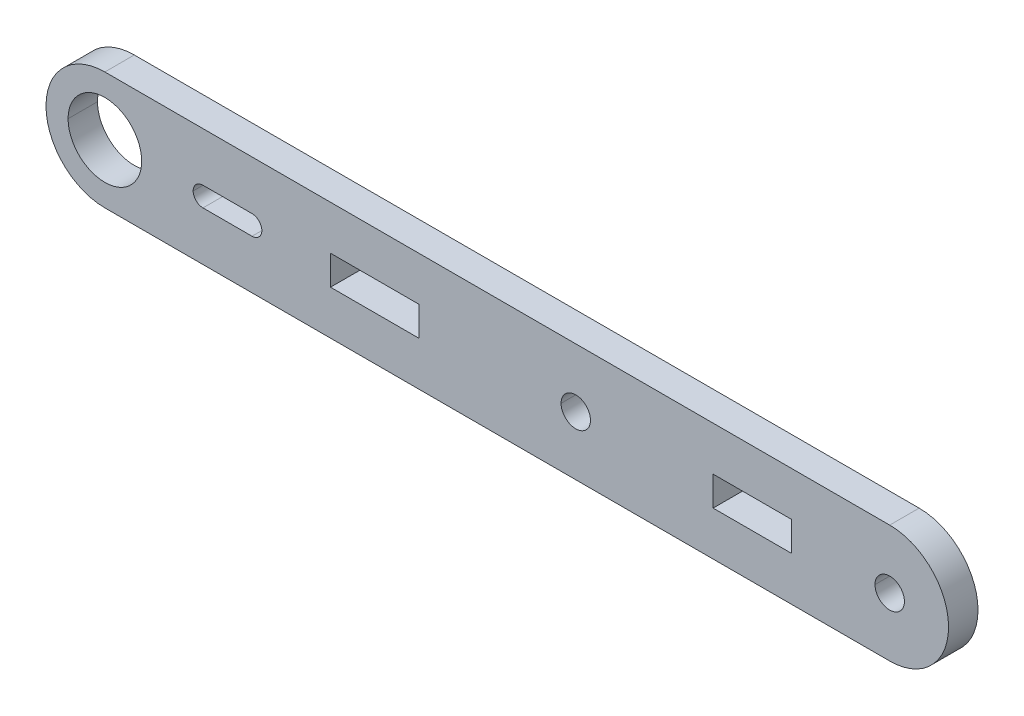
ISO-10303-21;
HEADER;
FILE_DESCRIPTION(('STEP AP214'),'2;1');
FILE_NAME('part.step','',(''),(''),'','','');
FILE_SCHEMA(('AUTOMOTIVE_DESIGN { 1 0 10303 214 1 1 1 1 }'));
ENDSEC;
DATA;
#1=APPLICATION_CONTEXT('core data for automotive mechanical design processes');
#2=APPLICATION_PROTOCOL_DEFINITION('international standard','automotive_design',2000,#1);
#3=PRODUCT_CONTEXT('',#1,'mechanical');
#4=PRODUCT('Part','Part','',(#3));
#5=PRODUCT_RELATED_PRODUCT_CATEGORY('part','',(#4));
#6=PRODUCT_DEFINITION_FORMATION('','',#4);
#7=PRODUCT_DEFINITION_CONTEXT('part definition',#1,'design');
#8=PRODUCT_DEFINITION('design','',#6,#7);
#9=PRODUCT_DEFINITION_SHAPE('','',#8);
#10=(LENGTH_UNIT() NAMED_UNIT(*) SI_UNIT(.MILLI.,.METRE.));
#11=(NAMED_UNIT(*) PLANE_ANGLE_UNIT() SI_UNIT($,.RADIAN.));
#12=(NAMED_UNIT(*) SI_UNIT($,.STERADIAN.) SOLID_ANGLE_UNIT());
#13=UNCERTAINTY_MEASURE_WITH_UNIT(LENGTH_MEASURE(1.E-05),#10,'distance_accuracy_value','');
#14=(GEOMETRIC_REPRESENTATION_CONTEXT(3) GLOBAL_UNCERTAINTY_ASSIGNED_CONTEXT((#13)) GLOBAL_UNIT_ASSIGNED_CONTEXT((#10,
#11,#12)) REPRESENTATION_CONTEXT('',''));
#15=CARTESIAN_POINT('',(0.,0.,0.));
#16=DIRECTION('',(0.,0.,1.));
#17=DIRECTION('',(1.,0.,0.));
#18=AXIS2_PLACEMENT_3D('',#15,#16,#17);
#19=CARTESIAN_POINT('',(-53.0402925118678,-53.50506394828,3.));
#20=DIRECTION('',(0.,0.,-1.));
#21=DIRECTION('',(-1.,0.,0.));
#22=AXIS2_PLACEMENT_3D('',#19,#20,#21);
#23=CYLINDRICAL_SURFACE('',#22,1.);
#24=DIRECTION('',(0.,0.,-1.));
#25=VECTOR('',#24,1.);
#26=CARTESIAN_POINT('',(-54.0402925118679,-53.50506394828,3.));
#27=LINE('',#26,#25);
#28=CARTESIAN_POINT('',(-54.0402925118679,-53.50506394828,3.));
#29=VERTEX_POINT('',#28);
#30=CARTESIAN_POINT('',(-54.0402925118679,-53.50506394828,0.));
#31=VERTEX_POINT('',#30);
#32=EDGE_CURVE('E193',#29,#31,#27,.T.);
#33=ORIENTED_EDGE('',*,*,#32,.T.);
#34=CARTESIAN_POINT('',(-53.0402925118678,-53.50506394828,0.));
#35=DIRECTION('',(0.,0.,-1.));
#36=DIRECTION('',(-1.,0.,0.));
#37=AXIS2_PLACEMENT_3D('',#34,#35,#36);
#38=CIRCLE('',#37,1.);
#39=CARTESIAN_POINT('',(-53.0402925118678,-52.50506394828,0.));
#40=VERTEX_POINT('',#39);
#41=EDGE_CURVE('E18',#40,#31,#38,.F.);
#42=ORIENTED_EDGE('',*,*,#41,.F.);
#43=DIRECTION('',(0.,0.,-1.));
#44=VECTOR('',#43,1.);
#45=CARTESIAN_POINT('',(-53.0402925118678,-52.50506394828,3.));
#46=LINE('',#45,#44);
#47=CARTESIAN_POINT('',(-53.0402925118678,-52.50506394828,3.));
#48=VERTEX_POINT('',#47);
#49=EDGE_CURVE('E213',#48,#40,#46,.T.);
#50=ORIENTED_EDGE('',*,*,#49,.F.);
#51=CARTESIAN_POINT('',(-53.0402925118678,-53.50506394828,3.));
#52=DIRECTION('',(0.,0.,-1.));
#53=DIRECTION('',(-1.,0.,0.));
#54=AXIS2_PLACEMENT_3D('',#51,#52,#53);
#55=CIRCLE('',#54,1.);
#56=EDGE_CURVE('E196',#29,#48,#55,.T.);
#57=ORIENTED_EDGE('',*,*,#56,.F.);
#58=EDGE_LOOP('',(#33,#42,#50,#57));
#59=FACE_BOUND('',#58,.T.);
#60=ADVANCED_FACE('F15',(#59),#23,.F.);
#61=CARTESIAN_POINT('',(-53.0402925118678,-53.50506394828,3.));
#62=DIRECTION('',(0.,0.,-1.));
#63=DIRECTION('',(-1.,0.,0.));
#64=AXIS2_PLACEMENT_3D('',#61,#62,#63);
#65=CYLINDRICAL_SURFACE('',#64,1.);
#66=CARTESIAN_POINT('',(-53.0402925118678,-53.50506394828,3.));
#67=DIRECTION('',(0.,0.,-1.));
#68=DIRECTION('',(-1.,0.,0.));
#69=AXIS2_PLACEMENT_3D('',#66,#67,#68);
#70=CIRCLE('',#69,1.);
#71=CARTESIAN_POINT('',(-53.0402925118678,-54.50506394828,3.));
#72=VERTEX_POINT('',#71);
#73=EDGE_CURVE('E191',#72,#29,#70,.T.);
#74=ORIENTED_EDGE('',*,*,#73,.F.);
#75=DIRECTION('',(0.,0.,1.));
#76=VECTOR('',#75,1.);
#77=CARTESIAN_POINT('',(-53.0402925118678,-54.50506394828,3.));
#78=LINE('',#77,#76);
#79=CARTESIAN_POINT('',(-53.0402925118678,-54.50506394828,0.));
#80=VERTEX_POINT('',#79);
#81=EDGE_CURVE('E180',#80,#72,#78,.T.);
#82=ORIENTED_EDGE('',*,*,#81,.F.);
#83=CARTESIAN_POINT('',(-53.0402925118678,-53.50506394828,0.));
#84=DIRECTION('',(0.,0.,-1.));
#85=DIRECTION('',(-1.,0.,0.));
#86=AXIS2_PLACEMENT_3D('',#83,#84,#85);
#87=CIRCLE('',#86,1.);
#88=EDGE_CURVE('E33',#31,#80,#87,.F.);
#89=ORIENTED_EDGE('',*,*,#88,.F.);
#90=ORIENTED_EDGE('',*,*,#32,.F.);
#91=EDGE_LOOP('',(#74,#82,#89,#90));
#92=FACE_BOUND('',#91,.T.);
#93=ADVANCED_FACE('F192',(#92),#65,.F.);
#94=CARTESIAN_POINT('',(-63.0402925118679,-53.50506394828,3.));
#95=DIRECTION('',(0.,0.,1.));
#96=DIRECTION('',(1.,0.,0.));
#97=AXIS2_PLACEMENT_3D('',#94,#95,#96);
#98=PLANE('',#97);
#99=DIRECTION('',(1.,0.,0.));
#100=VECTOR('',#99,1.);
#101=CARTESIAN_POINT('',(-53.0402925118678,-52.50506394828,3.));
#102=LINE('',#101,#100);
#103=CARTESIAN_POINT('',(-48.0402925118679,-52.50506394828,3.));
#104=VERTEX_POINT('',#103);
#105=EDGE_CURVE('E210',#104,#48,#102,.F.);
#106=ORIENTED_EDGE('',*,*,#105,.F.);
#107=CARTESIAN_POINT('',(-48.0402925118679,-53.50506394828,3.));
#108=DIRECTION('',(0.,0.,-1.));
#109=DIRECTION('',(-1.,0.,0.));
#110=AXIS2_PLACEMENT_3D('',#107,#108,#109);
#111=CIRCLE('',#110,1.);
#112=CARTESIAN_POINT('',(-48.0402925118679,-54.50506394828,3.));
#113=VERTEX_POINT('',#112);
#114=EDGE_CURVE('E187',#104,#113,#111,.T.);
#115=ORIENTED_EDGE('',*,*,#114,.T.);
#116=DIRECTION('',(1.,0.,0.));
#117=VECTOR('',#116,1.);
#118=CARTESIAN_POINT('',(-53.0402925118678,-54.50506394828,3.));
#119=LINE('',#118,#117);
#120=EDGE_CURVE('E184',#72,#113,#119,.T.);
#121=ORIENTED_EDGE('',*,*,#120,.F.);
#122=ORIENTED_EDGE('',*,*,#73,.T.);
#123=ORIENTED_EDGE('',*,*,#56,.T.);
#124=EDGE_LOOP('',(#106,#115,#121,#122,#123));
#125=FACE_BOUND('',#124,.T.);
#126=DIRECTION('',(1.,0.,0.));
#127=VECTOR('',#126,1.);
#128=CARTESIAN_POINT('',(-31.0402925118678,-55.00506394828,3.));
#129=LINE('',#128,#127);
#130=CARTESIAN_POINT('',(-40.0402925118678,-55.00506394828,3.));
#131=VERTEX_POINT('',#130);
#132=CARTESIAN_POINT('',(-31.0402925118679,-55.00506394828,3.));
#133=VERTEX_POINT('',#132);
#134=EDGE_CURVE('E264',#131,#133,#129,.T.);
#135=ORIENTED_EDGE('',*,*,#134,.F.);
#136=DIRECTION('',(0.,1.,0.));
#137=VECTOR('',#136,1.);
#138=CARTESIAN_POINT('',(-40.0402925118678,-55.00506394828,3.));
#139=LINE('',#138,#137);
#140=CARTESIAN_POINT('',(-40.0402925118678,-52.00506394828,3.));
#141=VERTEX_POINT('',#140);
#142=EDGE_CURVE('E315',#141,#131,#139,.F.);
#143=ORIENTED_EDGE('',*,*,#142,.F.);
#144=DIRECTION('',(1.,0.,0.));
#145=VECTOR('',#144,1.);
#146=CARTESIAN_POINT('',(-31.0402925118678,-52.00506394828,3.));
#147=LINE('',#146,#145);
#148=CARTESIAN_POINT('',(-31.0402925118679,-52.00506394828,3.));
#149=VERTEX_POINT('',#148);
#150=EDGE_CURVE('E311',#149,#141,#147,.F.);
#151=ORIENTED_EDGE('',*,*,#150,.F.);
#152=DIRECTION('',(0.,1.,0.));
#153=VECTOR('',#152,1.);
#154=CARTESIAN_POINT('',(-31.0402925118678,-55.00506394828,3.));
#155=LINE('',#154,#153);
#156=EDGE_CURVE('E304',#133,#149,#155,.T.);
#157=ORIENTED_EDGE('',*,*,#156,.F.);
#158=EDGE_LOOP('',(#135,#143,#151,#157));
#159=FACE_BOUND('',#158,.T.);
#160=CARTESIAN_POINT('',(16.9597074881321,-53.50506394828,3.));
#161=DIRECTION('',(0.,0.,-1.));
#162=DIRECTION('',(-1.,0.,0.));
#163=AXIS2_PLACEMENT_3D('',#160,#161,#162);
#164=CIRCLE('',#163,1.50000000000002);
#165=CARTESIAN_POINT('',(18.4597074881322,-53.50506394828,3.));
#166=VERTEX_POINT('',#165);
#167=CARTESIAN_POINT('',(15.4597074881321,-53.50506394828,3.));
#168=VERTEX_POINT('',#167);
#169=EDGE_CURVE('E261',#166,#168,#164,.T.);
#170=ORIENTED_EDGE('',*,*,#169,.T.);
#171=CARTESIAN_POINT('',(16.9597074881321,-53.50506394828,3.));
#172=DIRECTION('',(0.,0.,-1.));
#173=DIRECTION('',(-1.,0.,0.));
#174=AXIS2_PLACEMENT_3D('',#171,#172,#173);
#175=CIRCLE('',#174,1.50000000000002);
#176=EDGE_CURVE('E266',#168,#166,#175,.T.);
#177=ORIENTED_EDGE('',*,*,#176,.T.);
#178=EDGE_LOOP('',(#170,#177));
#179=FACE_BOUND('',#178,.T.);
#180=CARTESIAN_POINT('',(16.9597074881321,-53.50506394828,3.));
#181=DIRECTION('',(0.,0.,-1.));
#182=DIRECTION('',(-1.,0.,0.));
#183=AXIS2_PLACEMENT_3D('',#180,#181,#182);
#184=CIRCLE('',#183,6.00000000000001);
#185=CARTESIAN_POINT('',(16.9597074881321,-47.50506394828,3.));
#186=VERTEX_POINT('',#185);
#187=CARTESIAN_POINT('',(16.9597074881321,-59.50506394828,3.));
#188=VERTEX_POINT('',#187);
#189=EDGE_CURVE('E222',#186,#188,#184,.T.);
#190=ORIENTED_EDGE('',*,*,#189,.F.);
#191=DIRECTION('',(1.,0.,0.));
#192=VECTOR('',#191,1.);
#193=CARTESIAN_POINT('',(-63.0402925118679,-47.50506394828,3.));
#194=LINE('',#193,#192);
#195=CARTESIAN_POINT('',(-63.0402925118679,-47.50506394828,3.));
#196=VERTEX_POINT('',#195);
#197=EDGE_CURVE('E214',#186,#196,#194,.F.);
#198=ORIENTED_EDGE('',*,*,#197,.T.);
#199=CARTESIAN_POINT('',(-63.0402925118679,-53.50506394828,3.));
#200=DIRECTION('',(0.,0.,-1.));
#201=DIRECTION('',(-1.,0.,0.));
#202=AXIS2_PLACEMENT_3D('',#199,#200,#201);
#203=CIRCLE('',#202,6.00000000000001);
#204=CARTESIAN_POINT('',(-69.0402925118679,-53.50506394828,3.));
#205=VERTEX_POINT('',#204);
#206=EDGE_CURVE('E270',#205,#196,#203,.T.);
#207=ORIENTED_EDGE('',*,*,#206,.F.);
#208=CARTESIAN_POINT('',(-63.0402925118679,-53.50506394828,3.));
#209=DIRECTION('',(0.,0.,-1.));
#210=DIRECTION('',(-1.,0.,0.));
#211=AXIS2_PLACEMENT_3D('',#208,#209,#210);
#212=CIRCLE('',#211,6.00000000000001);
#213=CARTESIAN_POINT('',(-63.0402925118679,-59.50506394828,3.));
#214=VERTEX_POINT('',#213);
#215=EDGE_CURVE('E274',#214,#205,#212,.T.);
#216=ORIENTED_EDGE('',*,*,#215,.F.);
#217=DIRECTION('',(-1.,0.,0.));
#218=VECTOR('',#217,1.);
#219=CARTESIAN_POINT('',(-63.0402925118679,-59.50506394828,3.));
#220=LINE('',#219,#218);
#221=EDGE_CURVE('E219',#214,#188,#220,.F.);
#222=ORIENTED_EDGE('',*,*,#221,.T.);
#223=EDGE_LOOP('',(#190,#198,#207,#216,#222));
#224=FACE_BOUND('',#223,.T.);
#225=CARTESIAN_POINT('',(-15.0402925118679,-53.50506394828,3.));
#226=DIRECTION('',(0.,0.,-1.));
#227=DIRECTION('',(-1.,0.,0.));
#228=AXIS2_PLACEMENT_3D('',#225,#226,#227);
#229=CIRCLE('',#228,1.5);
#230=CARTESIAN_POINT('',(-13.5402925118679,-53.50506394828,3.));
#231=VERTEX_POINT('',#230);
#232=CARTESIAN_POINT('',(-16.5402925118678,-53.50506394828,3.));
#233=VERTEX_POINT('',#232);
#234=EDGE_CURVE('E276',#231,#233,#229,.T.);
#235=ORIENTED_EDGE('',*,*,#234,.T.);
#236=CARTESIAN_POINT('',(-15.0402925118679,-53.50506394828,3.));
#237=DIRECTION('',(0.,0.,-1.));
#238=DIRECTION('',(-1.,0.,0.));
#239=AXIS2_PLACEMENT_3D('',#236,#237,#238);
#240=CIRCLE('',#239,1.5);
#241=EDGE_CURVE('E280',#233,#231,#240,.T.);
#242=ORIENTED_EDGE('',*,*,#241,.T.);
#243=EDGE_LOOP('',(#235,#242));
#244=FACE_BOUND('',#243,.T.);
#245=CARTESIAN_POINT('',(-63.0402925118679,-53.50506394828,3.));
#246=DIRECTION('',(0.,0.,-1.));
#247=DIRECTION('',(-1.,0.,0.));
#248=AXIS2_PLACEMENT_3D('',#245,#246,#247);
#249=CIRCLE('',#248,3.75);
#250=CARTESIAN_POINT('',(-59.2902925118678,-53.50506394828,3.));
#251=VERTEX_POINT('',#250);
#252=CARTESIAN_POINT('',(-66.7902925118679,-53.50506394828,3.));
#253=VERTEX_POINT('',#252);
#254=EDGE_CURVE('E283',#251,#253,#249,.T.);
#255=ORIENTED_EDGE('',*,*,#254,.T.);
#256=CARTESIAN_POINT('',(-63.0402925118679,-53.50506394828,3.));
#257=DIRECTION('',(0.,0.,-1.));
#258=DIRECTION('',(-1.,0.,0.));
#259=AXIS2_PLACEMENT_3D('',#256,#257,#258);
#260=CIRCLE('',#259,3.75);
#261=EDGE_CURVE('E287',#253,#251,#260,.T.);
#262=ORIENTED_EDGE('',*,*,#261,.T.);
#263=EDGE_LOOP('',(#255,#262));
#264=FACE_BOUND('',#263,.T.);
#265=DIRECTION('',(1.,0.,0.));
#266=VECTOR('',#265,1.);
#267=CARTESIAN_POINT('',(6.95970748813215,-55.00506394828,3.));
#268=LINE('',#267,#266);
#269=CARTESIAN_POINT('',(-1.04029251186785,-55.00506394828,3.));
#270=VERTEX_POINT('',#269);
#271=CARTESIAN_POINT('',(6.95970748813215,-55.00506394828,3.));
#272=VERTEX_POINT('',#271);
#273=EDGE_CURVE('E208',#270,#272,#268,.T.);
#274=ORIENTED_EDGE('',*,*,#273,.F.);
#275=DIRECTION('',(0.,1.,0.));
#276=VECTOR('',#275,1.);
#277=CARTESIAN_POINT('',(-1.04029251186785,-55.00506394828,3.));
#278=LINE('',#277,#276);
#279=CARTESIAN_POINT('',(-1.04029251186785,-52.00506394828,3.));
#280=VERTEX_POINT('',#279);
#281=EDGE_CURVE('E349',#280,#270,#278,.F.);
#282=ORIENTED_EDGE('',*,*,#281,.F.);
#283=DIRECTION('',(1.,0.,0.));
#284=VECTOR('',#283,1.);
#285=CARTESIAN_POINT('',(6.95970748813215,-52.00506394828,3.));
#286=LINE('',#285,#284);
#287=CARTESIAN_POINT('',(6.95970748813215,-52.00506394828,3.));
#288=VERTEX_POINT('',#287);
#289=EDGE_CURVE('E346',#288,#280,#286,.F.);
#290=ORIENTED_EDGE('',*,*,#289,.F.);
#291=DIRECTION('',(0.,-1.,0.));
#292=VECTOR('',#291,1.);
#293=CARTESIAN_POINT('',(6.95970748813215,-55.00506394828,3.));
#294=LINE('',#293,#292);
#295=EDGE_CURVE('E339',#272,#288,#294,.F.);
#296=ORIENTED_EDGE('',*,*,#295,.F.);
#297=EDGE_LOOP('',(#274,#282,#290,#296));
#298=FACE_BOUND('',#297,.T.);
#299=ADVANCED_FACE('F198',(#125,#159,#179,#224,#244,#264,#298),#98,.T.);
#300=CARTESIAN_POINT('',(6.95970748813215,-55.00506394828,3.));
#301=DIRECTION('',(0.,1.,0.));
#302=DIRECTION('',(0.,0.,1.));
#303=AXIS2_PLACEMENT_3D('',#300,#301,#302);
#304=PLANE('',#303);
#305=ORIENTED_EDGE('',*,*,#273,.T.);
#306=DIRECTION('',(0.,0.,1.));
#307=VECTOR('',#306,1.);
#308=CARTESIAN_POINT('',(6.95970748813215,-55.00506394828,3.));
#309=LINE('',#308,#307);
#310=CARTESIAN_POINT('',(6.95970748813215,-55.00506394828,0.));
#311=VERTEX_POINT('',#310);
#312=EDGE_CURVE('E341',#311,#272,#309,.T.);
#313=ORIENTED_EDGE('',*,*,#312,.F.);
#314=DIRECTION('',(1.,0.,0.));
#315=VECTOR('',#314,1.);
#316=CARTESIAN_POINT('',(-63.0402925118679,-55.00506394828,0.));
#317=LINE('',#316,#315);
#318=CARTESIAN_POINT('',(-1.04029251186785,-55.00506394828,0.));
#319=VERTEX_POINT('',#318);
#320=EDGE_CURVE('E204',#311,#319,#317,.F.);
#321=ORIENTED_EDGE('',*,*,#320,.T.);
#322=DIRECTION('',(0.,0.,1.));
#323=VECTOR('',#322,1.);
#324=CARTESIAN_POINT('',(-1.04029251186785,-55.00506394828,3.));
#325=LINE('',#324,#323);
#326=EDGE_CURVE('E348',#270,#319,#325,.F.);
#327=ORIENTED_EDGE('',*,*,#326,.F.);
#328=EDGE_LOOP('',(#305,#313,#321,#327));
#329=FACE_BOUND('',#328,.T.);
#330=ADVANCED_FACE('F357',(#329),#304,.T.);
#331=CARTESIAN_POINT('',(-1.04029251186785,-55.00506394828,3.));
#332=DIRECTION('',(1.,0.,0.));
#333=DIRECTION('',(0.,1.,0.));
#334=AXIS2_PLACEMENT_3D('',#331,#332,#333);
#335=PLANE('',#334);
#336=ORIENTED_EDGE('',*,*,#281,.T.);
#337=ORIENTED_EDGE('',*,*,#326,.T.);
#338=DIRECTION('',(0.,1.,0.));
#339=VECTOR('',#338,1.);
#340=CARTESIAN_POINT('',(-1.04029251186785,-53.50506394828,0.));
#341=LINE('',#340,#339);
#342=CARTESIAN_POINT('',(-1.04029251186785,-52.00506394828,0.));
#343=VERTEX_POINT('',#342);
#344=EDGE_CURVE('E376',#319,#343,#341,.T.);
#345=ORIENTED_EDGE('',*,*,#344,.T.);
#346=DIRECTION('',(0.,0.,1.));
#347=VECTOR('',#346,1.);
#348=CARTESIAN_POINT('',(-1.04029251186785,-52.00506394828,3.));
#349=LINE('',#348,#347);
#350=EDGE_CURVE('E344',#280,#343,#349,.F.);
#351=ORIENTED_EDGE('',*,*,#350,.F.);
#352=EDGE_LOOP('',(#336,#337,#345,#351));
#353=FACE_BOUND('',#352,.T.);
#354=ADVANCED_FACE('F382',(#353),#335,.T.);
#355=CARTESIAN_POINT('',(6.95970748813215,-52.00506394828,3.));
#356=DIRECTION('',(0.,-1.,0.));
#357=DIRECTION('',(1.,0.,0.));
#358=AXIS2_PLACEMENT_3D('',#355,#356,#357);
#359=PLANE('',#358);
#360=ORIENTED_EDGE('',*,*,#289,.T.);
#361=ORIENTED_EDGE('',*,*,#350,.T.);
#362=DIRECTION('',(1.,0.,0.));
#363=VECTOR('',#362,1.);
#364=CARTESIAN_POINT('',(-63.0402925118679,-52.00506394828,0.));
#365=LINE('',#364,#363);
#366=CARTESIAN_POINT('',(6.95970748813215,-52.00506394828,0.));
#367=VERTEX_POINT('',#366);
#368=EDGE_CURVE('E371',#343,#367,#365,.T.);
#369=ORIENTED_EDGE('',*,*,#368,.T.);
#370=DIRECTION('',(0.,0.,1.));
#371=VECTOR('',#370,1.);
#372=CARTESIAN_POINT('',(6.95970748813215,-52.00506394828,3.));
#373=LINE('',#372,#371);
#374=EDGE_CURVE('E290',#288,#367,#373,.F.);
#375=ORIENTED_EDGE('',*,*,#374,.F.);
#376=EDGE_LOOP('',(#360,#361,#369,#375));
#377=FACE_BOUND('',#376,.T.);
#378=ADVANCED_FACE('F369',(#377),#359,.T.);
#379=CARTESIAN_POINT('',(6.95970748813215,-55.00506394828,3.));
#380=DIRECTION('',(-1.,0.,0.));
#381=DIRECTION('',(0.,-1.,0.));
#382=AXIS2_PLACEMENT_3D('',#379,#380,#381);
#383=PLANE('',#382);
#384=ORIENTED_EDGE('',*,*,#295,.T.);
#385=ORIENTED_EDGE('',*,*,#374,.T.);
#386=DIRECTION('',(0.,1.,0.));
#387=VECTOR('',#386,1.);
#388=CARTESIAN_POINT('',(6.95970748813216,-53.50506394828,0.));
#389=LINE('',#388,#387);
#390=EDGE_CURVE('E258',#367,#311,#389,.F.);
#391=ORIENTED_EDGE('',*,*,#390,.T.);
#392=ORIENTED_EDGE('',*,*,#312,.T.);
#393=EDGE_LOOP('',(#384,#385,#391,#392));
#394=FACE_BOUND('',#393,.T.);
#395=ADVANCED_FACE('F363',(#394),#383,.T.);
#396=CARTESIAN_POINT('',(-63.0402925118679,-53.50506394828,3.));
#397=DIRECTION('',(0.,0.,-1.));
#398=DIRECTION('',(-1.,0.,0.));
#399=AXIS2_PLACEMENT_3D('',#396,#397,#398);
#400=CYLINDRICAL_SURFACE('',#399,3.75);
#401=ORIENTED_EDGE('',*,*,#261,.F.);
#402=DIRECTION('',(0.,0.,-1.));
#403=VECTOR('',#402,1.);
#404=CARTESIAN_POINT('',(-66.7902925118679,-53.50506394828,3.));
#405=LINE('',#404,#403);
#406=CARTESIAN_POINT('',(-66.7902925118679,-53.50506394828,0.));
#407=VERTEX_POINT('',#406);
#408=EDGE_CURVE('E289',#253,#407,#405,.T.);
#409=ORIENTED_EDGE('',*,*,#408,.T.);
#410=CARTESIAN_POINT('',(-63.0402925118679,-53.50506394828,0.));
#411=DIRECTION('',(0.,0.,-1.));
#412=DIRECTION('',(-1.,0.,0.));
#413=AXIS2_PLACEMENT_3D('',#410,#411,#412);
#414=CIRCLE('',#413,3.75);
#415=CARTESIAN_POINT('',(-59.2902925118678,-53.50506394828,0.));
#416=VERTEX_POINT('',#415);
#417=EDGE_CURVE('E255',#407,#416,#414,.T.);
#418=ORIENTED_EDGE('',*,*,#417,.T.);
#419=DIRECTION('',(0.,0.,-1.));
#420=VECTOR('',#419,1.);
#421=CARTESIAN_POINT('',(-59.2902925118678,-53.50506394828,3.));
#422=LINE('',#421,#420);
#423=EDGE_CURVE('E286',#416,#251,#422,.F.);
#424=ORIENTED_EDGE('',*,*,#423,.T.);
#425=EDGE_LOOP('',(#401,#409,#418,#424));
#426=FACE_BOUND('',#425,.T.);
#427=ADVANCED_FACE('F458',(#426),#400,.F.);
#428=CARTESIAN_POINT('',(-63.0402925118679,-53.50506394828,3.));
#429=DIRECTION('',(0.,0.,-1.));
#430=DIRECTION('',(-1.,0.,0.));
#431=AXIS2_PLACEMENT_3D('',#428,#429,#430);
#432=CYLINDRICAL_SURFACE('',#431,3.75);
#433=ORIENTED_EDGE('',*,*,#423,.F.);
#434=CARTESIAN_POINT('',(-63.0402925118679,-53.50506394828,0.));
#435=DIRECTION('',(0.,0.,-1.));
#436=DIRECTION('',(-1.,0.,0.));
#437=AXIS2_PLACEMENT_3D('',#434,#435,#436);
#438=CIRCLE('',#437,3.75);
#439=EDGE_CURVE('E252',#416,#407,#438,.T.);
#440=ORIENTED_EDGE('',*,*,#439,.T.);
#441=ORIENTED_EDGE('',*,*,#408,.F.);
#442=ORIENTED_EDGE('',*,*,#254,.F.);
#443=EDGE_LOOP('',(#433,#440,#441,#442));
#444=FACE_BOUND('',#443,.T.);
#445=ADVANCED_FACE('F454',(#444),#432,.F.);
#446=CARTESIAN_POINT('',(-15.0402925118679,-53.50506394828,3.));
#447=DIRECTION('',(0.,0.,-1.));
#448=DIRECTION('',(-1.,0.,0.));
#449=AXIS2_PLACEMENT_3D('',#446,#447,#448);
#450=CYLINDRICAL_SURFACE('',#449,1.5);
#451=ORIENTED_EDGE('',*,*,#241,.F.);
#452=DIRECTION('',(0.,0.,-1.));
#453=VECTOR('',#452,1.);
#454=CARTESIAN_POINT('',(-16.5402925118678,-53.50506394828,3.));
#455=LINE('',#454,#453);
#456=CARTESIAN_POINT('',(-16.5402925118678,-53.50506394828,0.));
#457=VERTEX_POINT('',#456);
#458=EDGE_CURVE('E282',#233,#457,#455,.T.);
#459=ORIENTED_EDGE('',*,*,#458,.T.);
#460=CARTESIAN_POINT('',(-15.0402925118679,-53.50506394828,0.));
#461=DIRECTION('',(0.,0.,-1.));
#462=DIRECTION('',(-1.,0.,0.));
#463=AXIS2_PLACEMENT_3D('',#460,#461,#462);
#464=CIRCLE('',#463,1.5);
#465=CARTESIAN_POINT('',(-13.5402925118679,-53.50506394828,0.));
#466=VERTEX_POINT('',#465);
#467=EDGE_CURVE('E249',#457,#466,#464,.T.);
#468=ORIENTED_EDGE('',*,*,#467,.T.);
#469=DIRECTION('',(0.,0.,-1.));
#470=VECTOR('',#469,1.);
#471=CARTESIAN_POINT('',(-13.5402925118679,-53.50506394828,3.));
#472=LINE('',#471,#470);
#473=EDGE_CURVE('E279',#466,#231,#472,.F.);
#474=ORIENTED_EDGE('',*,*,#473,.T.);
#475=EDGE_LOOP('',(#451,#459,#468,#474));
#476=FACE_BOUND('',#475,.T.);
#477=ADVANCED_FACE('F450',(#476),#450,.F.);
#478=CARTESIAN_POINT('',(-15.0402925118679,-53.50506394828,3.));
#479=DIRECTION('',(0.,0.,-1.));
#480=DIRECTION('',(-1.,0.,0.));
#481=AXIS2_PLACEMENT_3D('',#478,#479,#480);
#482=CYLINDRICAL_SURFACE('',#481,1.5);
#483=ORIENTED_EDGE('',*,*,#473,.F.);
#484=CARTESIAN_POINT('',(-15.0402925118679,-53.50506394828,0.));
#485=DIRECTION('',(0.,0.,-1.));
#486=DIRECTION('',(-1.,0.,0.));
#487=AXIS2_PLACEMENT_3D('',#484,#485,#486);
#488=CIRCLE('',#487,1.5);
#489=EDGE_CURVE('E246',#466,#457,#488,.T.);
#490=ORIENTED_EDGE('',*,*,#489,.T.);
#491=ORIENTED_EDGE('',*,*,#458,.F.);
#492=ORIENTED_EDGE('',*,*,#234,.F.);
#493=EDGE_LOOP('',(#483,#490,#491,#492));
#494=FACE_BOUND('',#493,.T.);
#495=ADVANCED_FACE('F446',(#494),#482,.F.);
#496=CARTESIAN_POINT('',(-63.0402925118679,-53.50506394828,3.));
#497=DIRECTION('',(0.,0.,-1.));
#498=DIRECTION('',(-1.,0.,0.));
#499=AXIS2_PLACEMENT_3D('',#496,#497,#498);
#500=CYLINDRICAL_SURFACE('',#499,6.00000000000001);
#501=CARTESIAN_POINT('',(-63.0402925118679,-53.50506394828,0.));
#502=DIRECTION('',(0.,0.,-1.));
#503=DIRECTION('',(-1.,0.,0.));
#504=AXIS2_PLACEMENT_3D('',#501,#502,#503);
#505=CIRCLE('',#504,6.00000000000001);
#506=CARTESIAN_POINT('',(-69.0402925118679,-53.50506394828,0.));
#507=VERTEX_POINT('',#506);
#508=CARTESIAN_POINT('',(-63.0402925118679,-59.50506394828,0.));
#509=VERTEX_POINT('',#508);
#510=EDGE_CURVE('E243',#507,#509,#505,.F.);
#511=ORIENTED_EDGE('',*,*,#510,.T.);
#512=DIRECTION('',(0.,0.,1.));
#513=VECTOR('',#512,1.);
#514=CARTESIAN_POINT('',(-63.0402925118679,-59.50506394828,3.));
#515=LINE('',#514,#513);
#516=EDGE_CURVE('E223',#509,#214,#515,.T.);
#517=ORIENTED_EDGE('',*,*,#516,.T.);
#518=ORIENTED_EDGE('',*,*,#215,.T.);
#519=DIRECTION('',(0.,0.,-1.));
#520=VECTOR('',#519,1.);
#521=CARTESIAN_POINT('',(-69.0402925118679,-53.50506394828,3.));
#522=LINE('',#521,#520);
#523=EDGE_CURVE('E217',#507,#205,#522,.F.);
#524=ORIENTED_EDGE('',*,*,#523,.F.);
#525=EDGE_LOOP('',(#511,#517,#518,#524));
#526=FACE_BOUND('',#525,.T.);
#527=ADVANCED_FACE('F442',(#526),#500,.T.);
#528=CARTESIAN_POINT('',(-63.0402925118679,-59.50506394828,3.));
#529=DIRECTION('',(0.,1.,0.));
#530=DIRECTION('',(-1.,0.,0.));
#531=AXIS2_PLACEMENT_3D('',#528,#529,#530);
#532=PLANE('',#531);
#533=DIRECTION('',(0.,0.,-1.));
#534=VECTOR('',#533,1.);
#535=CARTESIAN_POINT('',(16.9597074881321,-59.50506394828,3.));
#536=LINE('',#535,#534);
#537=CARTESIAN_POINT('',(16.9597074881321,-59.50506394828,0.));
#538=VERTEX_POINT('',#537);
#539=EDGE_CURVE('E273',#188,#538,#536,.T.);
#540=ORIENTED_EDGE('',*,*,#539,.F.);
#541=ORIENTED_EDGE('',*,*,#221,.F.);
#542=ORIENTED_EDGE('',*,*,#516,.F.);
#543=DIRECTION('',(1.,0.,0.));
#544=VECTOR('',#543,1.);
#545=CARTESIAN_POINT('',(-63.0402925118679,-59.50506394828,0.));
#546=LINE('',#545,#544);
#547=EDGE_CURVE('E242',#509,#538,#546,.T.);
#548=ORIENTED_EDGE('',*,*,#547,.T.);
#549=EDGE_LOOP('',(#540,#541,#542,#548));
#550=FACE_BOUND('',#549,.T.);
#551=ADVANCED_FACE('F438',(#550),#532,.F.);
#552=CARTESIAN_POINT('',(16.9597074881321,-53.50506394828,3.));
#553=DIRECTION('',(0.,0.,-1.));
#554=DIRECTION('',(-1.,0.,0.));
#555=AXIS2_PLACEMENT_3D('',#552,#553,#554);
#556=CYLINDRICAL_SURFACE('',#555,6.00000000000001);
#557=ORIENTED_EDGE('',*,*,#189,.T.);
#558=ORIENTED_EDGE('',*,*,#539,.T.);
#559=CARTESIAN_POINT('',(16.9597074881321,-53.50506394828,0.));
#560=DIRECTION('',(0.,0.,-1.));
#561=DIRECTION('',(-1.,0.,0.));
#562=AXIS2_PLACEMENT_3D('',#559,#560,#561);
#563=CIRCLE('',#562,6.00000000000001);
#564=CARTESIAN_POINT('',(16.9597074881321,-47.50506394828,0.));
#565=VERTEX_POINT('',#564);
#566=EDGE_CURVE('E239',#538,#565,#563,.F.);
#567=ORIENTED_EDGE('',*,*,#566,.T.);
#568=DIRECTION('',(0.,0.,1.));
#569=VECTOR('',#568,1.);
#570=CARTESIAN_POINT('',(16.9597074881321,-47.50506394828,3.));
#571=LINE('',#570,#569);
#572=EDGE_CURVE('E218',#565,#186,#571,.T.);
#573=ORIENTED_EDGE('',*,*,#572,.T.);
#574=EDGE_LOOP('',(#557,#558,#567,#573));
#575=FACE_BOUND('',#574,.T.);
#576=ADVANCED_FACE('F434',(#575),#556,.T.);
#577=CARTESIAN_POINT('',(-63.0402925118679,-47.50506394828,3.));
#578=DIRECTION('',(0.,-1.,0.));
#579=DIRECTION('',(1.,0.,0.));
#580=AXIS2_PLACEMENT_3D('',#577,#578,#579);
#581=PLANE('',#580);
#582=DIRECTION('',(0.,0.,-1.));
#583=VECTOR('',#582,1.);
#584=CARTESIAN_POINT('',(-63.0402925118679,-47.50506394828,3.));
#585=LINE('',#584,#583);
#586=CARTESIAN_POINT('',(-63.0402925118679,-47.50506394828,0.));
#587=VERTEX_POINT('',#586);
#588=EDGE_CURVE('E269',#196,#587,#585,.T.);
#589=ORIENTED_EDGE('',*,*,#588,.F.);
#590=ORIENTED_EDGE('',*,*,#197,.F.);
#591=ORIENTED_EDGE('',*,*,#572,.F.);
#592=DIRECTION('',(1.,0.,0.));
#593=VECTOR('',#592,1.);
#594=CARTESIAN_POINT('',(-63.0402925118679,-47.50506394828,0.));
#595=LINE('',#594,#593);
#596=EDGE_CURVE('E238',#565,#587,#595,.F.);
#597=ORIENTED_EDGE('',*,*,#596,.T.);
#598=EDGE_LOOP('',(#589,#590,#591,#597));
#599=FACE_BOUND('',#598,.T.);
#600=ADVANCED_FACE('F430',(#599),#581,.F.);
#601=CARTESIAN_POINT('',(-63.0402925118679,-53.50506394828,3.));
#602=DIRECTION('',(0.,0.,-1.));
#603=DIRECTION('',(-1.,0.,0.));
#604=AXIS2_PLACEMENT_3D('',#601,#602,#603);
#605=CYLINDRICAL_SURFACE('',#604,6.00000000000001);
#606=ORIENTED_EDGE('',*,*,#588,.T.);
#607=CARTESIAN_POINT('',(-63.0402925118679,-53.50506394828,0.));
#608=DIRECTION('',(0.,0.,-1.));
#609=DIRECTION('',(-1.,0.,0.));
#610=AXIS2_PLACEMENT_3D('',#607,#608,#609);
#611=CIRCLE('',#610,6.00000000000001);
#612=EDGE_CURVE('E235',#587,#507,#611,.F.);
#613=ORIENTED_EDGE('',*,*,#612,.T.);
#614=ORIENTED_EDGE('',*,*,#523,.T.);
#615=ORIENTED_EDGE('',*,*,#206,.T.);
#616=EDGE_LOOP('',(#606,#613,#614,#615));
#617=FACE_BOUND('',#616,.T.);
#618=ADVANCED_FACE('F426',(#617),#605,.T.);
#619=CARTESIAN_POINT('',(16.9597074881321,-53.50506394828,3.));
#620=DIRECTION('',(0.,0.,-1.));
#621=DIRECTION('',(-1.,0.,0.));
#622=AXIS2_PLACEMENT_3D('',#619,#620,#621);
#623=CYLINDRICAL_SURFACE('',#622,1.50000000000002);
#624=ORIENTED_EDGE('',*,*,#176,.F.);
#625=DIRECTION('',(0.,0.,-1.));
#626=VECTOR('',#625,1.);
#627=CARTESIAN_POINT('',(15.4597074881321,-53.50506394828,3.));
#628=LINE('',#627,#626);
#629=CARTESIAN_POINT('',(15.4597074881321,-53.50506394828,0.));
#630=VERTEX_POINT('',#629);
#631=EDGE_CURVE('E268',#168,#630,#628,.T.);
#632=ORIENTED_EDGE('',*,*,#631,.T.);
#633=CARTESIAN_POINT('',(16.9597074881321,-53.50506394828,0.));
#634=DIRECTION('',(0.,0.,-1.));
#635=DIRECTION('',(-1.,0.,0.));
#636=AXIS2_PLACEMENT_3D('',#633,#634,#635);
#637=CIRCLE('',#636,1.50000000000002);
#638=CARTESIAN_POINT('',(18.4597074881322,-53.50506394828,0.));
#639=VERTEX_POINT('',#638);
#640=EDGE_CURVE('E232',#630,#639,#637,.T.);
#641=ORIENTED_EDGE('',*,*,#640,.T.);
#642=DIRECTION('',(0.,0.,-1.));
#643=VECTOR('',#642,1.);
#644=CARTESIAN_POINT('',(18.4597074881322,-53.50506394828,3.));
#645=LINE('',#644,#643);
#646=EDGE_CURVE('E265',#639,#166,#645,.F.);
#647=ORIENTED_EDGE('',*,*,#646,.T.);
#648=EDGE_LOOP('',(#624,#632,#641,#647));
#649=FACE_BOUND('',#648,.T.);
#650=ADVANCED_FACE('F422',(#649),#623,.F.);
#651=CARTESIAN_POINT('',(16.9597074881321,-53.50506394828,3.));
#652=DIRECTION('',(0.,0.,-1.));
#653=DIRECTION('',(-1.,0.,0.));
#654=AXIS2_PLACEMENT_3D('',#651,#652,#653);
#655=CYLINDRICAL_SURFACE('',#654,1.50000000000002);
#656=ORIENTED_EDGE('',*,*,#646,.F.);
#657=CARTESIAN_POINT('',(16.9597074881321,-53.50506394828,0.));
#658=DIRECTION('',(0.,0.,-1.));
#659=DIRECTION('',(-1.,0.,0.));
#660=AXIS2_PLACEMENT_3D('',#657,#658,#659);
#661=CIRCLE('',#660,1.50000000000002);
#662=EDGE_CURVE('E228',#639,#630,#661,.T.);
#663=ORIENTED_EDGE('',*,*,#662,.T.);
#664=ORIENTED_EDGE('',*,*,#631,.F.);
#665=ORIENTED_EDGE('',*,*,#169,.F.);
#666=EDGE_LOOP('',(#656,#663,#664,#665));
#667=FACE_BOUND('',#666,.T.);
#668=ADVANCED_FACE('F418',(#667),#655,.F.);
#669=CARTESIAN_POINT('',(-31.0402925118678,-55.00506394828,3.));
#670=DIRECTION('',(0.,1.,0.));
#671=DIRECTION('',(0.,0.,1.));
#672=AXIS2_PLACEMENT_3D('',#669,#670,#671);
#673=PLANE('',#672);
#674=ORIENTED_EDGE('',*,*,#134,.T.);
#675=DIRECTION('',(0.,0.,1.));
#676=VECTOR('',#675,1.);
#677=CARTESIAN_POINT('',(-31.0402925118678,-55.00506394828,3.));
#678=LINE('',#677,#676);
#679=CARTESIAN_POINT('',(-31.0402925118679,-55.00506394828,0.));
#680=VERTEX_POINT('',#679);
#681=EDGE_CURVE('E306',#680,#133,#678,.T.);
#682=ORIENTED_EDGE('',*,*,#681,.F.);
#683=DIRECTION('',(1.,0.,0.));
#684=VECTOR('',#683,1.);
#685=CARTESIAN_POINT('',(-63.0402925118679,-55.00506394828,0.));
#686=LINE('',#685,#684);
#687=CARTESIAN_POINT('',(-40.0402925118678,-55.00506394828,0.));
#688=VERTEX_POINT('',#687);
#689=EDGE_CURVE('E231',#680,#688,#686,.F.);
#690=ORIENTED_EDGE('',*,*,#689,.T.);
#691=DIRECTION('',(0.,0.,-1.));
#692=VECTOR('',#691,1.);
#693=CARTESIAN_POINT('',(-40.0402925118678,-55.00506394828,3.));
#694=LINE('',#693,#692);
#695=EDGE_CURVE('E313',#131,#688,#694,.T.);
#696=ORIENTED_EDGE('',*,*,#695,.F.);
#697=EDGE_LOOP('',(#674,#682,#690,#696));
#698=FACE_BOUND('',#697,.T.);
#699=ADVANCED_FACE('F414',(#698),#673,.T.);
#700=CARTESIAN_POINT('',(-40.0402925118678,-55.00506394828,3.));
#701=DIRECTION('',(1.,0.,0.));
#702=DIRECTION('',(0.,0.,-1.));
#703=AXIS2_PLACEMENT_3D('',#700,#701,#702);
#704=PLANE('',#703);
#705=ORIENTED_EDGE('',*,*,#142,.T.);
#706=ORIENTED_EDGE('',*,*,#695,.T.);
#707=DIRECTION('',(0.,1.,0.));
#708=VECTOR('',#707,1.);
#709=CARTESIAN_POINT('',(-40.0402925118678,-53.50506394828,0.));
#710=LINE('',#709,#708);
#711=CARTESIAN_POINT('',(-40.0402925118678,-52.00506394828,0.));
#712=VERTEX_POINT('',#711);
#713=EDGE_CURVE('E600',#688,#712,#710,.T.);
#714=ORIENTED_EDGE('',*,*,#713,.T.);
#715=DIRECTION('',(0.,0.,1.));
#716=VECTOR('',#715,1.);
#717=CARTESIAN_POINT('',(-40.0402925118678,-52.00506394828,3.));
#718=LINE('',#717,#716);
#719=EDGE_CURVE('E309',#141,#712,#718,.F.);
#720=ORIENTED_EDGE('',*,*,#719,.F.);
#721=EDGE_LOOP('',(#705,#706,#714,#720));
#722=FACE_BOUND('',#721,.T.);
#723=ADVANCED_FACE('F410',(#722),#704,.T.);
#724=CARTESIAN_POINT('',(-31.0402925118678,-52.00506394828,3.));
#725=DIRECTION('',(0.,-1.,0.));
#726=DIRECTION('',(1.,0.,0.));
#727=AXIS2_PLACEMENT_3D('',#724,#725,#726);
#728=PLANE('',#727);
#729=ORIENTED_EDGE('',*,*,#150,.T.);
#730=ORIENTED_EDGE('',*,*,#719,.T.);
#731=DIRECTION('',(1.,0.,0.));
#732=VECTOR('',#731,1.);
#733=CARTESIAN_POINT('',(-63.0402925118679,-52.00506394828,0.));
#734=LINE('',#733,#732);
#735=CARTESIAN_POINT('',(-31.0402925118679,-52.00506394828,0.));
#736=VERTEX_POINT('',#735);
#737=EDGE_CURVE('E603',#712,#736,#734,.T.);
#738=ORIENTED_EDGE('',*,*,#737,.T.);
#739=DIRECTION('',(0.,0.,1.));
#740=VECTOR('',#739,1.);
#741=CARTESIAN_POINT('',(-31.0402925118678,-52.00506394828,3.));
#742=LINE('',#741,#740);
#743=EDGE_CURVE('E57',#149,#736,#742,.F.);
#744=ORIENTED_EDGE('',*,*,#743,.F.);
#745=EDGE_LOOP('',(#729,#730,#738,#744));
#746=FACE_BOUND('',#745,.T.);
#747=ADVANCED_FACE('F407',(#746),#728,.T.);
#748=CARTESIAN_POINT('',(-31.0402925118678,-55.00506394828,3.));
#749=DIRECTION('',(-1.,0.,0.));
#750=DIRECTION('',(0.,0.,1.));
#751=AXIS2_PLACEMENT_3D('',#748,#749,#750);
#752=PLANE('',#751);
#753=ORIENTED_EDGE('',*,*,#156,.T.);
#754=ORIENTED_EDGE('',*,*,#743,.T.);
#755=DIRECTION('',(0.,1.,0.));
#756=VECTOR('',#755,1.);
#757=CARTESIAN_POINT('',(-31.0402925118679,-53.50506394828,0.));
#758=LINE('',#757,#756);
#759=EDGE_CURVE('E606',#736,#680,#758,.F.);
#760=ORIENTED_EDGE('',*,*,#759,.T.);
#761=ORIENTED_EDGE('',*,*,#681,.T.);
#762=EDGE_LOOP('',(#753,#754,#760,#761));
#763=FACE_BOUND('',#762,.T.);
#764=ADVANCED_FACE('F404',(#763),#752,.T.);
#765=CARTESIAN_POINT('',(-53.0402925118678,-52.50506394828,3.));
#766=DIRECTION('',(0.,-1.,0.));
#767=DIRECTION('',(0.,0.,-1.));
#768=AXIS2_PLACEMENT_3D('',#765,#766,#767);
#769=PLANE('',#768);
#770=ORIENTED_EDGE('',*,*,#105,.T.);
#771=ORIENTED_EDGE('',*,*,#49,.T.);
#772=DIRECTION('',(1.,0.,0.));
#773=VECTOR('',#772,1.);
#774=CARTESIAN_POINT('',(-63.0402925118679,-52.50506394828,0.));
#775=LINE('',#774,#773);
#776=CARTESIAN_POINT('',(-48.0402925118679,-52.50506394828,0.));
#777=VERTEX_POINT('',#776);
#778=EDGE_CURVE('E227',#40,#777,#775,.T.);
#779=ORIENTED_EDGE('',*,*,#778,.T.);
#780=DIRECTION('',(0.,0.,-1.));
#781=VECTOR('',#780,1.);
#782=CARTESIAN_POINT('',(-48.0402925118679,-52.50506394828,3.));
#783=LINE('',#782,#781);
#784=EDGE_CURVE('E260',#777,#104,#783,.F.);
#785=ORIENTED_EDGE('',*,*,#784,.T.);
#786=EDGE_LOOP('',(#770,#771,#779,#785));
#787=FACE_BOUND('',#786,.T.);
#788=ADVANCED_FACE('F298',(#787),#769,.T.);
#789=CARTESIAN_POINT('',(-48.0402925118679,-53.50506394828,3.));
#790=DIRECTION('',(0.,0.,-1.));
#791=DIRECTION('',(-1.,0.,0.));
#792=AXIS2_PLACEMENT_3D('',#789,#790,#791);
#793=CYLINDRICAL_SURFACE('',#792,1.);
#794=DIRECTION('',(0.,0.,1.));
#795=VECTOR('',#794,1.);
#796=CARTESIAN_POINT('',(-48.0402925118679,-54.50506394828,3.));
#797=LINE('',#796,#795);
#798=CARTESIAN_POINT('',(-48.0402925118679,-54.50506394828,0.));
#799=VERTEX_POINT('',#798);
#800=EDGE_CURVE('E202',#113,#799,#797,.F.);
#801=ORIENTED_EDGE('',*,*,#800,.F.);
#802=ORIENTED_EDGE('',*,*,#114,.F.);
#803=ORIENTED_EDGE('',*,*,#784,.F.);
#804=CARTESIAN_POINT('',(-48.0402925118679,-53.50506394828,0.));
#805=DIRECTION('',(0.,0.,-1.));
#806=DIRECTION('',(-1.,0.,0.));
#807=AXIS2_PLACEMENT_3D('',#804,#805,#806);
#808=CIRCLE('',#807,1.);
#809=EDGE_CURVE('E24',#777,#799,#808,.T.);
#810=ORIENTED_EDGE('',*,*,#809,.T.);
#811=EDGE_LOOP('',(#801,#802,#803,#810));
#812=FACE_BOUND('',#811,.T.);
#813=ADVANCED_FACE('F397',(#812),#793,.F.);
#814=CARTESIAN_POINT('',(-53.0402925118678,-54.50506394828,3.));
#815=DIRECTION('',(0.,1.,0.));
#816=DIRECTION('',(0.,0.,1.));
#817=AXIS2_PLACEMENT_3D('',#814,#815,#816);
#818=PLANE('',#817);
#819=ORIENTED_EDGE('',*,*,#120,.T.);
#820=ORIENTED_EDGE('',*,*,#800,.T.);
#821=DIRECTION('',(1.,0.,0.));
#822=VECTOR('',#821,1.);
#823=CARTESIAN_POINT('',(-63.0402925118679,-54.50506394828,0.));
#824=LINE('',#823,#822);
#825=EDGE_CURVE('E9',#799,#80,#824,.F.);
#826=ORIENTED_EDGE('',*,*,#825,.T.);
#827=ORIENTED_EDGE('',*,*,#81,.T.);
#828=EDGE_LOOP('',(#819,#820,#826,#827));
#829=FACE_BOUND('',#828,.T.);
#830=ADVANCED_FACE('F182',(#829),#818,.T.);
#831=CARTESIAN_POINT('',(-63.0402925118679,-53.50506394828,0.));
#832=DIRECTION('',(0.,0.,1.));
#833=DIRECTION('',(1.,0.,0.));
#834=AXIS2_PLACEMENT_3D('',#831,#832,#833);
#835=PLANE('',#834);
#836=ORIENTED_EDGE('',*,*,#88,.T.);
#837=ORIENTED_EDGE('',*,*,#825,.F.);
#838=ORIENTED_EDGE('',*,*,#809,.F.);
#839=ORIENTED_EDGE('',*,*,#778,.F.);
#840=ORIENTED_EDGE('',*,*,#41,.T.);
#841=EDGE_LOOP('',(#836,#837,#838,#839,#840));
#842=FACE_BOUND('',#841,.T.);
#843=ORIENTED_EDGE('',*,*,#737,.F.);
#844=ORIENTED_EDGE('',*,*,#713,.F.);
#845=ORIENTED_EDGE('',*,*,#689,.F.);
#846=ORIENTED_EDGE('',*,*,#759,.F.);
#847=EDGE_LOOP('',(#843,#844,#845,#846));
#848=FACE_BOUND('',#847,.T.);
#849=ORIENTED_EDGE('',*,*,#640,.F.);
#850=ORIENTED_EDGE('',*,*,#662,.F.);
#851=EDGE_LOOP('',(#849,#850));
#852=FACE_BOUND('',#851,.T.);
#853=ORIENTED_EDGE('',*,*,#596,.F.);
#854=ORIENTED_EDGE('',*,*,#566,.F.);
#855=ORIENTED_EDGE('',*,*,#547,.F.);
#856=ORIENTED_EDGE('',*,*,#510,.F.);
#857=ORIENTED_EDGE('',*,*,#612,.F.);
#858=EDGE_LOOP('',(#853,#854,#855,#856,#857));
#859=FACE_BOUND('',#858,.T.);
#860=ORIENTED_EDGE('',*,*,#467,.F.);
#861=ORIENTED_EDGE('',*,*,#489,.F.);
#862=EDGE_LOOP('',(#860,#861));
#863=FACE_BOUND('',#862,.T.);
#864=ORIENTED_EDGE('',*,*,#417,.F.);
#865=ORIENTED_EDGE('',*,*,#439,.F.);
#866=EDGE_LOOP('',(#864,#865));
#867=FACE_BOUND('',#866,.T.);
#868=ORIENTED_EDGE('',*,*,#368,.F.);
#869=ORIENTED_EDGE('',*,*,#344,.F.);
#870=ORIENTED_EDGE('',*,*,#320,.F.);
#871=ORIENTED_EDGE('',*,*,#390,.F.);
#872=EDGE_LOOP('',(#868,#869,#870,#871));
#873=FACE_BOUND('',#872,.T.);
#874=ADVANCED_FACE('F292',(#842,#848,#852,#859,#863,#867,#873),#835,.F.);
#875=CLOSED_SHELL('',(#60,#93,#299,#330,#354,#378,#395,#427,#445,#477,#495,#527,#551,#576,#600,
#618,#650,#668,#699,#723,#747,#764,#788,#813,#830,#874));
#876=MANIFOLD_SOLID_BREP('B1',#875);
#877=ADVANCED_BREP_SHAPE_REPRESENTATION('',(#18,#876),#14);
#878=SHAPE_DEFINITION_REPRESENTATION(#9,#877);
ENDSEC;
END-ISO-10303-21;
